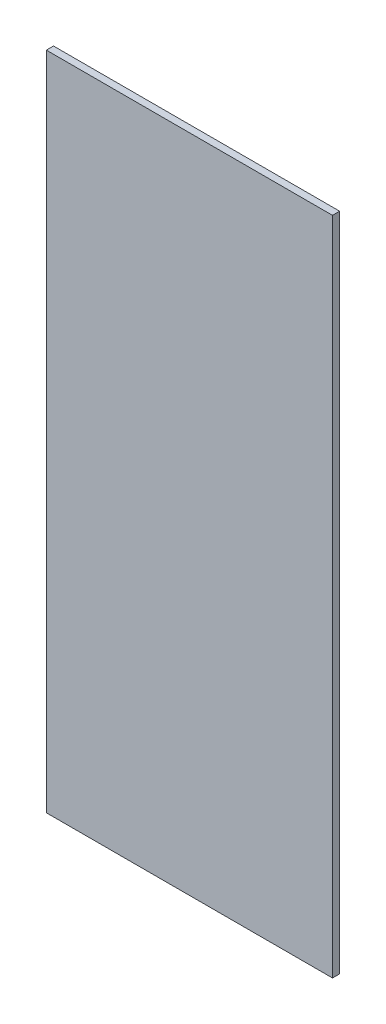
from build123d import *

# Parameters (mm, degrees)
CROQUIS1_W              = 600
CROQUIS1_H              = 1385
SALIENTE_EXTRUIR1_DEPTH = 15


with BuildPart() as part:
    # Croquis1 → Saliente-Extruir1 (new body)
    with BuildSketch(Plane.XY):
        Rectangle(CROQUIS1_W, CROQUIS1_H)
    extrude(amount=SALIENTE_EXTRUIR1_DEPTH)


solid = part.part
